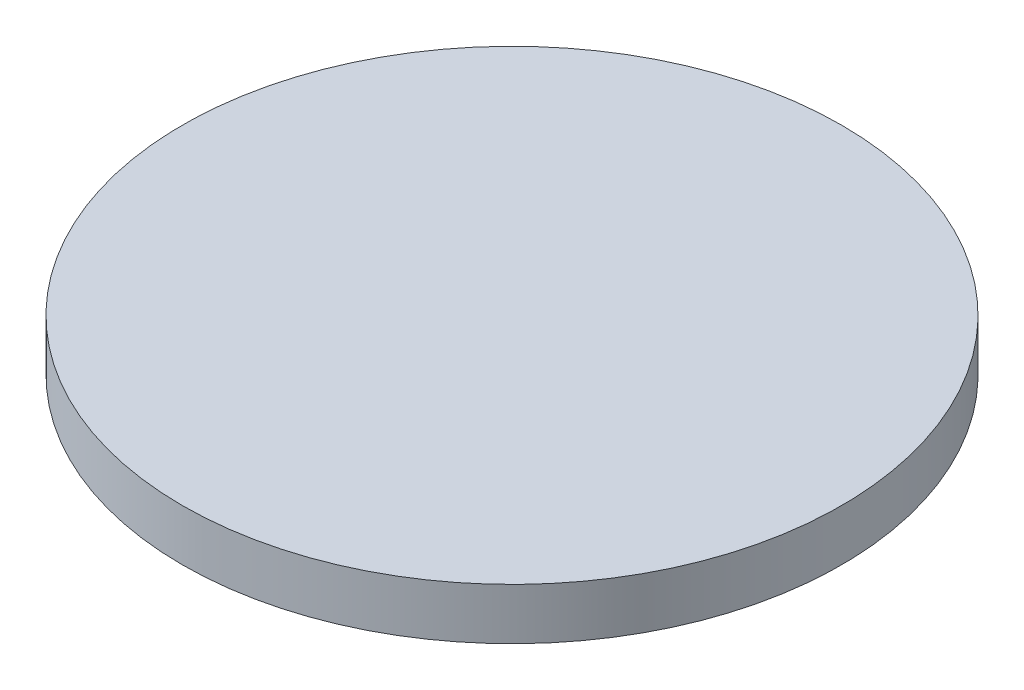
ISO-10303-21;
HEADER;
FILE_DESCRIPTION(('STEP AP214'),'2;1');
FILE_NAME('part.step','',(''),(''),'','','');
FILE_SCHEMA(('AUTOMOTIVE_DESIGN { 1 0 10303 214 1 1 1 1 }'));
ENDSEC;
DATA;
#1=APPLICATION_CONTEXT('core data for automotive mechanical design processes');
#2=APPLICATION_PROTOCOL_DEFINITION('international standard','automotive_design',2000,#1);
#3=PRODUCT_CONTEXT('',#1,'mechanical');
#4=PRODUCT('Part','Part','',(#3));
#5=PRODUCT_RELATED_PRODUCT_CATEGORY('part','',(#4));
#6=PRODUCT_DEFINITION_FORMATION('','',#4);
#7=PRODUCT_DEFINITION_CONTEXT('part definition',#1,'design');
#8=PRODUCT_DEFINITION('design','',#6,#7);
#9=PRODUCT_DEFINITION_SHAPE('','',#8);
#10=(LENGTH_UNIT() NAMED_UNIT(*) SI_UNIT(.MILLI.,.METRE.));
#11=(NAMED_UNIT(*) PLANE_ANGLE_UNIT() SI_UNIT($,.RADIAN.));
#12=(NAMED_UNIT(*) SI_UNIT($,.STERADIAN.) SOLID_ANGLE_UNIT());
#13=UNCERTAINTY_MEASURE_WITH_UNIT(LENGTH_MEASURE(1.E-05),#10,'distance_accuracy_value','');
#14=(GEOMETRIC_REPRESENTATION_CONTEXT(3) GLOBAL_UNCERTAINTY_ASSIGNED_CONTEXT((#13)) GLOBAL_UNIT_ASSIGNED_CONTEXT((#10,
#11,#12)) REPRESENTATION_CONTEXT('',''));
#15=CARTESIAN_POINT('',(0.,0.,0.));
#16=DIRECTION('',(0.,0.,1.));
#17=DIRECTION('',(1.,0.,0.));
#18=AXIS2_PLACEMENT_3D('',#15,#16,#17);
#19=CARTESIAN_POINT('',(0.,3.,0.));
#20=DIRECTION('',(0.,-1.,0.));
#21=DIRECTION('',(0.,0.,-1.));
#22=AXIS2_PLACEMENT_3D('',#19,#20,#21);
#23=CYLINDRICAL_SURFACE('',#22,19.25);
#24=CARTESIAN_POINT('',(0.,3.,0.));
#25=DIRECTION('',(0.,1.,0.));
#26=DIRECTION('',(0.,0.,1.));
#27=AXIS2_PLACEMENT_3D('',#24,#25,#26);
#28=CIRCLE('',#27,19.25);
#29=CARTESIAN_POINT('',(0.,3.,19.25));
#30=VERTEX_POINT('',#29);
#31=EDGE_CURVE('E11',#30,#30,#28,.T.);
#32=ORIENTED_EDGE('',*,*,#31,.F.);
#33=EDGE_LOOP('',(#32));
#34=FACE_BOUND('',#33,.T.);
#35=CARTESIAN_POINT('',(0.,0.,0.));
#36=DIRECTION('',(0.,1.,0.));
#37=DIRECTION('',(0.,0.,1.));
#38=AXIS2_PLACEMENT_3D('',#35,#36,#37);
#39=CIRCLE('',#38,19.25);
#40=CARTESIAN_POINT('',(0.,0.,19.25));
#41=VERTEX_POINT('',#40);
#42=EDGE_CURVE('E38',#41,#41,#39,.T.);
#43=ORIENTED_EDGE('',*,*,#42,.T.);
#44=EDGE_LOOP('',(#43));
#45=FACE_BOUND('',#44,.T.);
#46=ADVANCED_FACE('F35',(#34,#45),#23,.T.);
#47=CARTESIAN_POINT('',(0.,3.,0.));
#48=DIRECTION('',(0.,1.,0.));
#49=DIRECTION('',(0.,0.,1.));
#50=AXIS2_PLACEMENT_3D('',#47,#48,#49);
#51=PLANE('',#50);
#52=ORIENTED_EDGE('',*,*,#31,.T.);
#53=EDGE_LOOP('',(#52));
#54=FACE_BOUND('',#53,.T.);
#55=ADVANCED_FACE('F51',(#54),#51,.T.);
#56=CARTESIAN_POINT('',(0.,0.,0.));
#57=DIRECTION('',(0.,1.,0.));
#58=DIRECTION('',(0.,0.,1.));
#59=AXIS2_PLACEMENT_3D('',#56,#57,#58);
#60=PLANE('',#59);
#61=ORIENTED_EDGE('',*,*,#42,.F.);
#62=EDGE_LOOP('',(#61));
#63=FACE_BOUND('',#62,.T.);
#64=ADVANCED_FACE('F49',(#63),#60,.F.);
#65=CLOSED_SHELL('',(#46,#55,#64));
#66=MANIFOLD_SOLID_BREP('B2',#65);
#67=ADVANCED_BREP_SHAPE_REPRESENTATION('',(#18,#66),#14);
#68=SHAPE_DEFINITION_REPRESENTATION(#9,#67);
ENDSEC;
END-ISO-10303-21;
